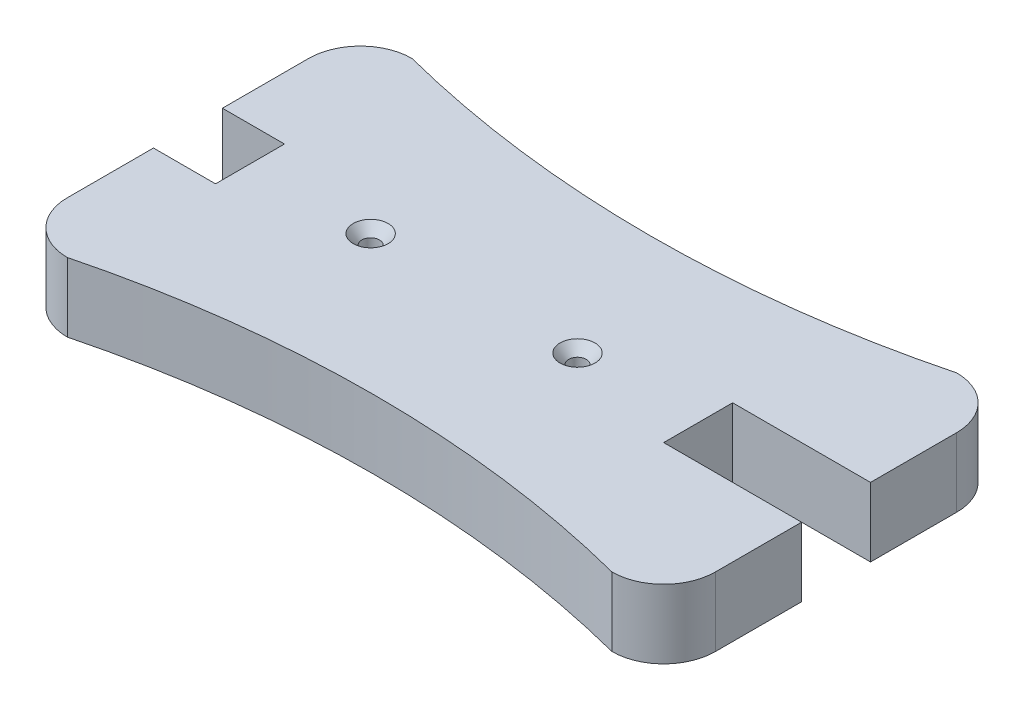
ISO-10303-21;
HEADER;
FILE_DESCRIPTION(('STEP AP214'),'2;1');
FILE_NAME('part.step','',(''),(''),'','','');
FILE_SCHEMA(('AUTOMOTIVE_DESIGN { 1 0 10303 214 1 1 1 1 }'));
ENDSEC;
DATA;
#1=APPLICATION_CONTEXT('core data for automotive mechanical design processes');
#2=APPLICATION_PROTOCOL_DEFINITION('international standard','automotive_design',2000,#1);
#3=PRODUCT_CONTEXT('',#1,'mechanical');
#4=PRODUCT('Part','Part','',(#3));
#5=PRODUCT_RELATED_PRODUCT_CATEGORY('part','',(#4));
#6=PRODUCT_DEFINITION_FORMATION('','',#4);
#7=PRODUCT_DEFINITION_CONTEXT('part definition',#1,'design');
#8=PRODUCT_DEFINITION('design','',#6,#7);
#9=PRODUCT_DEFINITION_SHAPE('','',#8);
#10=(LENGTH_UNIT() NAMED_UNIT(*) SI_UNIT(.MILLI.,.METRE.));
#11=(NAMED_UNIT(*) PLANE_ANGLE_UNIT() SI_UNIT($,.RADIAN.));
#12=(NAMED_UNIT(*) SI_UNIT($,.STERADIAN.) SOLID_ANGLE_UNIT());
#13=UNCERTAINTY_MEASURE_WITH_UNIT(LENGTH_MEASURE(1.E-05),#10,'distance_accuracy_value','');
#14=(GEOMETRIC_REPRESENTATION_CONTEXT(3) GLOBAL_UNCERTAINTY_ASSIGNED_CONTEXT((#13)) GLOBAL_UNIT_ASSIGNED_CONTEXT((#10,
#11,#12)) REPRESENTATION_CONTEXT('',''));
#15=CARTESIAN_POINT('',(0.,0.,0.));
#16=DIRECTION('',(0.,0.,1.));
#17=DIRECTION('',(1.,0.,0.));
#18=AXIS2_PLACEMENT_3D('',#15,#16,#17);
#19=CARTESIAN_POINT('',(82.55,12.7,63.5));
#20=DIRECTION('',(-1.,0.,0.));
#21=DIRECTION('',(0.,0.,1.));
#22=AXIS2_PLACEMENT_3D('',#19,#20,#21);
#23=PLANE('',#22);
#24=DIRECTION('',(0.,-1.,0.));
#25=VECTOR('',#24,1.);
#26=CARTESIAN_POINT('',(82.55,12.7,-12.7));
#27=LINE('',#26,#25);
#28=CARTESIAN_POINT('',(82.55,12.7,-12.7));
#29=VERTEX_POINT('',#28);
#30=CARTESIAN_POINT('',(82.55,-12.7,-12.7));
#31=VERTEX_POINT('',#30);
#32=EDGE_CURVE('E183',#29,#31,#27,.T.);
#33=ORIENTED_EDGE('',*,*,#32,.F.);
#34=DIRECTION('',(0.,0.,-1.));
#35=VECTOR('',#34,1.);
#36=CARTESIAN_POINT('',(82.55,12.7,63.5));
#37=LINE('',#36,#35);
#38=CARTESIAN_POINT('',(82.55,12.7,12.7));
#39=VERTEX_POINT('',#38);
#40=EDGE_CURVE('E217',#39,#29,#37,.T.);
#41=ORIENTED_EDGE('',*,*,#40,.F.);
#42=DIRECTION('',(0.,1.,0.));
#43=VECTOR('',#42,1.);
#44=CARTESIAN_POINT('',(82.55,12.7,12.7));
#45=LINE('',#44,#43);
#46=CARTESIAN_POINT('',(82.55,-12.7,12.7));
#47=VERTEX_POINT('',#46);
#48=EDGE_CURVE('E201',#47,#39,#45,.T.);
#49=ORIENTED_EDGE('',*,*,#48,.F.);
#50=DIRECTION('',(0.,0.,-1.));
#51=VECTOR('',#50,1.);
#52=CARTESIAN_POINT('',(82.55,-12.7,63.5));
#53=LINE('',#52,#51);
#54=EDGE_CURVE('E375',#47,#31,#53,.T.);
#55=ORIENTED_EDGE('',*,*,#54,.T.);
#56=EDGE_LOOP('',(#33,#41,#49,#55));
#57=FACE_BOUND('',#56,.T.);
#58=ADVANCED_FACE('F37',(#57),#23,.F.);
#59=CARTESIAN_POINT('',(-82.55,12.7,63.5));
#60=DIRECTION('',(1.,0.,0.));
#61=DIRECTION('',(0.,0.,-1.));
#62=AXIS2_PLACEMENT_3D('',#59,#60,#61);
#63=PLANE('',#62);
#64=DIRECTION('',(0.,-1.,0.));
#65=VECTOR('',#64,1.);
#66=CARTESIAN_POINT('',(-82.55,12.7,12.7));
#67=LINE('',#66,#65);
#68=CARTESIAN_POINT('',(-82.55,12.7,12.7));
#69=VERTEX_POINT('',#68);
#70=CARTESIAN_POINT('',(-82.55,-12.7,12.7));
#71=VERTEX_POINT('',#70);
#72=EDGE_CURVE('E227',#69,#71,#67,.T.);
#73=ORIENTED_EDGE('',*,*,#72,.F.);
#74=DIRECTION('',(0.,0.,1.));
#75=VECTOR('',#74,1.);
#76=CARTESIAN_POINT('',(-82.55,12.7,63.5));
#77=LINE('',#76,#75);
#78=CARTESIAN_POINT('',(-82.55,12.7,-12.7));
#79=VERTEX_POINT('',#78);
#80=EDGE_CURVE('E234',#79,#69,#77,.T.);
#81=ORIENTED_EDGE('',*,*,#80,.F.);
#82=DIRECTION('',(0.,1.,0.));
#83=VECTOR('',#82,1.);
#84=CARTESIAN_POINT('',(-82.55,12.7,-12.7));
#85=LINE('',#84,#83);
#86=CARTESIAN_POINT('',(-82.55,-12.7,-12.7));
#87=VERTEX_POINT('',#86);
#88=EDGE_CURVE('E365',#87,#79,#85,.T.);
#89=ORIENTED_EDGE('',*,*,#88,.F.);
#90=DIRECTION('',(0.,0.,1.));
#91=VECTOR('',#90,1.);
#92=CARTESIAN_POINT('',(-82.55,-12.7,63.5));
#93=LINE('',#92,#91);
#94=EDGE_CURVE('E329',#87,#71,#93,.T.);
#95=ORIENTED_EDGE('',*,*,#94,.T.);
#96=EDGE_LOOP('',(#73,#81,#89,#95));
#97=FACE_BOUND('',#96,.T.);
#98=ADVANCED_FACE('F276',(#97),#63,.F.);
#99=CARTESIAN_POINT('',(0.,12.7,0.));
#100=DIRECTION('',(0.,-1.,0.));
#101=DIRECTION('',(0.,0.,-1.));
#102=AXIS2_PLACEMENT_3D('',#99,#100,#101);
#103=PLANE('',#102);
#104=CARTESIAN_POINT('',(-38.1,12.7,0.));
#105=DIRECTION('',(0.,1.,0.));
#106=DIRECTION('',(0.,0.,1.));
#107=AXIS2_PLACEMENT_3D('',#104,#105,#106);
#108=CIRCLE('',#107,6.4389);
#109=CARTESIAN_POINT('',(-38.1,12.7,6.4389));
#110=VERTEX_POINT('',#109);
#111=EDGE_CURVE('E267',#110,#110,#108,.T.);
#112=ORIENTED_EDGE('',*,*,#111,.F.);
#113=EDGE_LOOP('',(#112));
#114=FACE_BOUND('',#113,.T.);
#115=CARTESIAN_POINT('',(38.1,12.7,0.));
#116=DIRECTION('',(0.,1.,0.));
#117=DIRECTION('',(0.,0.,1.));
#118=AXIS2_PLACEMENT_3D('',#115,#116,#117);
#119=CIRCLE('',#118,6.4389);
#120=CARTESIAN_POINT('',(38.1,12.7,6.4389));
#121=VERTEX_POINT('',#120);
#122=EDGE_CURVE('E257',#121,#121,#119,.T.);
#123=ORIENTED_EDGE('',*,*,#122,.F.);
#124=EDGE_LOOP('',(#123));
#125=FACE_BOUND('',#124,.T.);
#126=CARTESIAN_POINT('',(13.97,12.7,-453.4535));
#127=DIRECTION('',(0.,1.,0.));
#128=DIRECTION('',(0.,0.,1.));
#129=AXIS2_PLACEMENT_3D('',#126,#127,#128);
#130=CIRCLE('',#129,402.6535);
#131=CARTESIAN_POINT('',(-86.36,12.7,-63.5));
#132=VERTEX_POINT('',#131);
#133=CARTESIAN_POINT('',(114.3,12.7,-63.5));
#134=VERTEX_POINT('',#133);
#135=EDGE_CURVE('E175',#132,#134,#130,.T.);
#136=ORIENTED_EDGE('',*,*,#135,.F.);
#137=CARTESIAN_POINT('',(-86.36,12.7,-44.45));
#138=DIRECTION('',(0.,-1.,0.));
#139=DIRECTION('',(0.,0.,-1.));
#140=AXIS2_PLACEMENT_3D('',#137,#138,#139);
#141=CIRCLE('',#140,19.05);
#142=CARTESIAN_POINT('',(-105.41,12.7,-44.45));
#143=VERTEX_POINT('',#142);
#144=EDGE_CURVE('E247',#132,#143,#141,.F.);
#145=ORIENTED_EDGE('',*,*,#144,.T.);
#146=DIRECTION('',(0.,0.,-1.));
#147=VECTOR('',#146,1.);
#148=CARTESIAN_POINT('',(-105.41,12.7,-63.5));
#149=LINE('',#148,#147);
#150=CARTESIAN_POINT('',(-105.41,12.7,-12.7));
#151=VERTEX_POINT('',#150);
#152=EDGE_CURVE('E347',#151,#143,#149,.T.);
#153=ORIENTED_EDGE('',*,*,#152,.F.);
#154=DIRECTION('',(1.,0.,0.));
#155=VECTOR('',#154,1.);
#156=CARTESIAN_POINT('',(-105.41,12.7,-12.7));
#157=LINE('',#156,#155);
#158=EDGE_CURVE('E353',#151,#79,#157,.T.);
#159=ORIENTED_EDGE('',*,*,#158,.T.);
#160=ORIENTED_EDGE('',*,*,#80,.T.);
#161=DIRECTION('',(1.,0.,0.));
#162=VECTOR('',#161,1.);
#163=CARTESIAN_POINT('',(-105.41,12.7,12.7));
#164=LINE('',#163,#162);
#165=CARTESIAN_POINT('',(-105.41,12.7,12.7));
#166=VERTEX_POINT('',#165);
#167=EDGE_CURVE('E368',#166,#69,#164,.T.);
#168=ORIENTED_EDGE('',*,*,#167,.F.);
#169=DIRECTION('',(0.,0.,-1.));
#170=VECTOR('',#169,1.);
#171=CARTESIAN_POINT('',(-105.41,12.7,63.5));
#172=LINE('',#171,#170);
#173=CARTESIAN_POINT('',(-105.41,12.7,44.45));
#174=VERTEX_POINT('',#173);
#175=EDGE_CURVE('E159',#174,#166,#172,.T.);
#176=ORIENTED_EDGE('',*,*,#175,.F.);
#177=CARTESIAN_POINT('',(-86.36,12.7,44.45));
#178=DIRECTION('',(0.,-1.,0.));
#179=DIRECTION('',(0.,0.,-1.));
#180=AXIS2_PLACEMENT_3D('',#177,#178,#179);
#181=CIRCLE('',#180,19.05);
#182=CARTESIAN_POINT('',(-86.36,12.7,63.5));
#183=VERTEX_POINT('',#182);
#184=EDGE_CURVE('E54',#174,#183,#181,.F.);
#185=ORIENTED_EDGE('',*,*,#184,.T.);
#186=CARTESIAN_POINT('',(13.97,12.7,453.4535));
#187=DIRECTION('',(0.,1.,0.));
#188=DIRECTION('',(0.,0.,-1.));
#189=AXIS2_PLACEMENT_3D('',#186,#187,#188);
#190=CIRCLE('',#189,402.6535);
#191=CARTESIAN_POINT('',(114.3,12.7,63.5));
#192=VERTEX_POINT('',#191);
#193=EDGE_CURVE('E156',#192,#183,#190,.T.);
#194=ORIENTED_EDGE('',*,*,#193,.F.);
#195=CARTESIAN_POINT('',(114.3,12.7,44.45));
#196=DIRECTION('',(0.,-1.,0.));
#197=DIRECTION('',(0.,0.,-1.));
#198=AXIS2_PLACEMENT_3D('',#195,#196,#197);
#199=CIRCLE('',#198,19.05);
#200=CARTESIAN_POINT('',(133.35,12.7,44.45));
#201=VERTEX_POINT('',#200);
#202=EDGE_CURVE('E160',#192,#201,#199,.F.);
#203=ORIENTED_EDGE('',*,*,#202,.T.);
#204=DIRECTION('',(0.,0.,1.));
#205=VECTOR('',#204,1.);
#206=CARTESIAN_POINT('',(133.35,12.7,63.5));
#207=LINE('',#206,#205);
#208=CARTESIAN_POINT('',(133.35,12.7,12.7));
#209=VERTEX_POINT('',#208);
#210=EDGE_CURVE('E206',#209,#201,#207,.T.);
#211=ORIENTED_EDGE('',*,*,#210,.F.);
#212=DIRECTION('',(-1.,0.,0.));
#213=VECTOR('',#212,1.);
#214=CARTESIAN_POINT('',(133.35,12.7,12.7));
#215=LINE('',#214,#213);
#216=EDGE_CURVE('E209',#209,#39,#215,.T.);
#217=ORIENTED_EDGE('',*,*,#216,.T.);
#218=ORIENTED_EDGE('',*,*,#40,.T.);
#219=DIRECTION('',(-1.,0.,0.));
#220=VECTOR('',#219,1.);
#221=CARTESIAN_POINT('',(133.35,12.7,-12.7));
#222=LINE('',#221,#220);
#223=CARTESIAN_POINT('',(133.35,12.7,-12.7));
#224=VERTEX_POINT('',#223);
#225=EDGE_CURVE('E193',#224,#29,#222,.T.);
#226=ORIENTED_EDGE('',*,*,#225,.F.);
#227=DIRECTION('',(0.,0.,1.));
#228=VECTOR('',#227,1.);
#229=CARTESIAN_POINT('',(133.35,12.7,-12.7));
#230=LINE('',#229,#228);
#231=CARTESIAN_POINT('',(133.35,12.7,-44.45));
#232=VERTEX_POINT('',#231);
#233=EDGE_CURVE('E191',#232,#224,#230,.T.);
#234=ORIENTED_EDGE('',*,*,#233,.F.);
#235=CARTESIAN_POINT('',(114.3,12.7,-44.45));
#236=DIRECTION('',(0.,-1.,0.));
#237=DIRECTION('',(0.,0.,-1.));
#238=AXIS2_PLACEMENT_3D('',#235,#236,#237);
#239=CIRCLE('',#238,19.05);
#240=EDGE_CURVE('E61',#232,#134,#239,.F.);
#241=ORIENTED_EDGE('',*,*,#240,.T.);
#242=EDGE_LOOP('',(#136,#145,#153,#159,#160,#168,#176,#185,#194,#203,#211,#217,#218,#226,#234,#241));
#243=FACE_BOUND('',#242,.T.);
#244=ADVANCED_FACE('F155',(#114,#125,#243),#103,.F.);
#245=CARTESIAN_POINT('',(0.,-12.7,0.));
#246=DIRECTION('',(0.,-1.,0.));
#247=DIRECTION('',(0.,0.,-1.));
#248=AXIS2_PLACEMENT_3D('',#245,#246,#247);
#249=PLANE('',#248);
#250=CARTESIAN_POINT('',(-38.1,-12.7,0.));
#251=DIRECTION('',(0.,-1.,0.));
#252=DIRECTION('',(0.,0.,-1.));
#253=AXIS2_PLACEMENT_3D('',#250,#251,#252);
#254=CIRCLE('',#253,3.26389999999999);
#255=CARTESIAN_POINT('',(-38.1,-12.7,-3.26389999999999));
#256=VERTEX_POINT('',#255);
#257=EDGE_CURVE('E41',#256,#256,#254,.T.);
#258=ORIENTED_EDGE('',*,*,#257,.F.);
#259=EDGE_LOOP('',(#258));
#260=FACE_BOUND('',#259,.T.);
#261=CARTESIAN_POINT('',(38.1,-12.7,0.));
#262=DIRECTION('',(0.,-1.,0.));
#263=DIRECTION('',(0.,0.,-1.));
#264=AXIS2_PLACEMENT_3D('',#261,#262,#263);
#265=CIRCLE('',#264,3.26389999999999);
#266=CARTESIAN_POINT('',(38.1,-12.7,-3.26389999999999));
#267=VERTEX_POINT('',#266);
#268=EDGE_CURVE('E170',#267,#267,#265,.T.);
#269=ORIENTED_EDGE('',*,*,#268,.F.);
#270=EDGE_LOOP('',(#269));
#271=FACE_BOUND('',#270,.T.);
#272=DIRECTION('',(0.,0.,1.));
#273=VECTOR('',#272,1.);
#274=CARTESIAN_POINT('',(-105.41,-12.7,-63.5));
#275=LINE('',#274,#273);
#276=CARTESIAN_POINT('',(-105.41,-12.7,-44.45));
#277=VERTEX_POINT('',#276);
#278=CARTESIAN_POINT('',(-105.41,-12.7,-12.7));
#279=VERTEX_POINT('',#278);
#280=EDGE_CURVE('E357',#277,#279,#275,.T.);
#281=ORIENTED_EDGE('',*,*,#280,.F.);
#282=CARTESIAN_POINT('',(-86.36,-12.7,-44.45));
#283=DIRECTION('',(0.,-1.,0.));
#284=DIRECTION('',(0.,0.,-1.));
#285=AXIS2_PLACEMENT_3D('',#282,#283,#284);
#286=CIRCLE('',#285,19.05);
#287=CARTESIAN_POINT('',(-86.36,-12.7,-63.5));
#288=VERTEX_POINT('',#287);
#289=EDGE_CURVE('E161',#277,#288,#286,.T.);
#290=ORIENTED_EDGE('',*,*,#289,.T.);
#291=CARTESIAN_POINT('',(13.97,-12.7,-453.4535));
#292=DIRECTION('',(0.,-1.,0.));
#293=DIRECTION('',(0.,0.,-1.));
#294=AXIS2_PLACEMENT_3D('',#291,#292,#293);
#295=CIRCLE('',#294,402.6535);
#296=CARTESIAN_POINT('',(114.3,-12.7,-63.5));
#297=VERTEX_POINT('',#296);
#298=EDGE_CURVE('E230',#297,#288,#295,.T.);
#299=ORIENTED_EDGE('',*,*,#298,.F.);
#300=CARTESIAN_POINT('',(114.3,-12.7,-44.45));
#301=DIRECTION('',(0.,-1.,0.));
#302=DIRECTION('',(0.,0.,-1.));
#303=AXIS2_PLACEMENT_3D('',#300,#301,#302);
#304=CIRCLE('',#303,19.05);
#305=CARTESIAN_POINT('',(133.35,-12.7,-44.45));
#306=VERTEX_POINT('',#305);
#307=EDGE_CURVE('E242',#297,#306,#304,.T.);
#308=ORIENTED_EDGE('',*,*,#307,.T.);
#309=DIRECTION('',(0.,0.,-1.));
#310=VECTOR('',#309,1.);
#311=CARTESIAN_POINT('',(133.35,-12.7,-12.7));
#312=LINE('',#311,#310);
#313=CARTESIAN_POINT('',(133.35,-12.7,-12.7));
#314=VERTEX_POINT('',#313);
#315=EDGE_CURVE('E188',#314,#306,#312,.T.);
#316=ORIENTED_EDGE('',*,*,#315,.F.);
#317=DIRECTION('',(-1.,0.,0.));
#318=VECTOR('',#317,1.);
#319=CARTESIAN_POINT('',(133.35,-12.7,-12.7));
#320=LINE('',#319,#318);
#321=EDGE_CURVE('E198',#314,#31,#320,.T.);
#322=ORIENTED_EDGE('',*,*,#321,.T.);
#323=ORIENTED_EDGE('',*,*,#54,.F.);
#324=DIRECTION('',(-1.,0.,0.));
#325=VECTOR('',#324,1.);
#326=CARTESIAN_POINT('',(133.35,-12.7,12.7));
#327=LINE('',#326,#325);
#328=CARTESIAN_POINT('',(133.35,-12.7,12.7));
#329=VERTEX_POINT('',#328);
#330=EDGE_CURVE('E222',#329,#47,#327,.T.);
#331=ORIENTED_EDGE('',*,*,#330,.F.);
#332=DIRECTION('',(0.,0.,-1.));
#333=VECTOR('',#332,1.);
#334=CARTESIAN_POINT('',(133.35,-12.7,63.5));
#335=LINE('',#334,#333);
#336=CARTESIAN_POINT('',(133.35,-12.7,44.45));
#337=VERTEX_POINT('',#336);
#338=EDGE_CURVE('E202',#337,#329,#335,.T.);
#339=ORIENTED_EDGE('',*,*,#338,.F.);
#340=CARTESIAN_POINT('',(114.3,-12.7,44.45));
#341=DIRECTION('',(0.,-1.,0.));
#342=DIRECTION('',(0.,0.,-1.));
#343=AXIS2_PLACEMENT_3D('',#340,#341,#342);
#344=CIRCLE('',#343,19.05);
#345=CARTESIAN_POINT('',(114.3,-12.7,63.5));
#346=VERTEX_POINT('',#345);
#347=EDGE_CURVE('E240',#337,#346,#344,.T.);
#348=ORIENTED_EDGE('',*,*,#347,.T.);
#349=CARTESIAN_POINT('',(13.97,-12.7,453.4535));
#350=DIRECTION('',(0.,-1.,0.));
#351=DIRECTION('',(0.,0.,-1.));
#352=AXIS2_PLACEMENT_3D('',#349,#350,#351);
#353=CIRCLE('',#352,402.6535);
#354=CARTESIAN_POINT('',(-86.36,-12.7,63.5));
#355=VERTEX_POINT('',#354);
#356=EDGE_CURVE('E233',#355,#346,#353,.T.);
#357=ORIENTED_EDGE('',*,*,#356,.F.);
#358=CARTESIAN_POINT('',(-86.36,-12.7,44.45));
#359=DIRECTION('',(0.,-1.,0.));
#360=DIRECTION('',(0.,0.,-1.));
#361=AXIS2_PLACEMENT_3D('',#358,#359,#360);
#362=CIRCLE('',#361,19.05);
#363=CARTESIAN_POINT('',(-105.41,-12.7,44.45));
#364=VERTEX_POINT('',#363);
#365=EDGE_CURVE('E173',#355,#364,#362,.T.);
#366=ORIENTED_EDGE('',*,*,#365,.T.);
#367=DIRECTION('',(0.,0.,1.));
#368=VECTOR('',#367,1.);
#369=CARTESIAN_POINT('',(-105.41,-12.7,63.5));
#370=LINE('',#369,#368);
#371=CARTESIAN_POINT('',(-105.41,-12.7,12.7));
#372=VERTEX_POINT('',#371);
#373=EDGE_CURVE('E396',#372,#364,#370,.T.);
#374=ORIENTED_EDGE('',*,*,#373,.F.);
#375=DIRECTION('',(1.,0.,0.));
#376=VECTOR('',#375,1.);
#377=CARTESIAN_POINT('',(-105.41,-12.7,12.7));
#378=LINE('',#377,#376);
#379=EDGE_CURVE('E392',#372,#71,#378,.T.);
#380=ORIENTED_EDGE('',*,*,#379,.T.);
#381=ORIENTED_EDGE('',*,*,#94,.F.);
#382=DIRECTION('',(1.,0.,0.));
#383=VECTOR('',#382,1.);
#384=CARTESIAN_POINT('',(-105.41,-12.7,-12.7));
#385=LINE('',#384,#383);
#386=EDGE_CURVE('E355',#279,#87,#385,.T.);
#387=ORIENTED_EDGE('',*,*,#386,.F.);
#388=EDGE_LOOP('',(#281,#290,#299,#308,#316,#322,#323,#331,#339,#348,#357,#366,#374,#380,#381,#387));
#389=FACE_BOUND('',#388,.T.);
#390=ADVANCED_FACE('F275',(#260,#271,#389),#249,.T.);
#391=CARTESIAN_POINT('',(-105.41,12.7,-12.7));
#392=DIRECTION('',(0.,0.,-1.));
#393=DIRECTION('',(-1.,0.,0.));
#394=AXIS2_PLACEMENT_3D('',#391,#392,#393);
#395=PLANE('',#394);
#396=ORIENTED_EDGE('',*,*,#88,.T.);
#397=ORIENTED_EDGE('',*,*,#158,.F.);
#398=DIRECTION('',(0.,1.,0.));
#399=VECTOR('',#398,1.);
#400=CARTESIAN_POINT('',(-105.41,12.7,-12.7));
#401=LINE('',#400,#399);
#402=EDGE_CURVE('E351',#279,#151,#401,.T.);
#403=ORIENTED_EDGE('',*,*,#402,.F.);
#404=ORIENTED_EDGE('',*,*,#386,.T.);
#405=EDGE_LOOP('',(#396,#397,#403,#404));
#406=FACE_BOUND('',#405,.T.);
#407=ADVANCED_FACE('F402',(#406),#395,.F.);
#408=CARTESIAN_POINT('',(-105.41,0.,0.));
#409=DIRECTION('',(-1.,0.,0.));
#410=DIRECTION('',(0.,0.,1.));
#411=AXIS2_PLACEMENT_3D('',#408,#409,#410);
#412=PLANE('',#411);
#413=ORIENTED_EDGE('',*,*,#152,.T.);
#414=DIRECTION('',(0.,-1.,0.));
#415=VECTOR('',#414,1.);
#416=CARTESIAN_POINT('',(-105.41,-12.7,-44.45));
#417=LINE('',#416,#415);
#418=EDGE_CURVE('E236',#143,#277,#417,.T.);
#419=ORIENTED_EDGE('',*,*,#418,.T.);
#420=ORIENTED_EDGE('',*,*,#280,.T.);
#421=ORIENTED_EDGE('',*,*,#402,.T.);
#422=EDGE_LOOP('',(#413,#419,#420,#421));
#423=FACE_BOUND('',#422,.T.);
#424=ADVANCED_FACE('F349',(#423),#412,.T.);
#425=CARTESIAN_POINT('',(-105.41,12.7,12.7));
#426=DIRECTION('',(0.,0.,1.));
#427=DIRECTION('',(1.,0.,0.));
#428=AXIS2_PLACEMENT_3D('',#425,#426,#427);
#429=PLANE('',#428);
#430=ORIENTED_EDGE('',*,*,#72,.T.);
#431=ORIENTED_EDGE('',*,*,#379,.F.);
#432=DIRECTION('',(0.,-1.,0.));
#433=VECTOR('',#432,1.);
#434=CARTESIAN_POINT('',(-105.41,12.7,12.7));
#435=LINE('',#434,#433);
#436=EDGE_CURVE('E399',#166,#372,#435,.T.);
#437=ORIENTED_EDGE('',*,*,#436,.F.);
#438=ORIENTED_EDGE('',*,*,#167,.T.);
#439=EDGE_LOOP('',(#430,#431,#437,#438));
#440=FACE_BOUND('',#439,.T.);
#441=ADVANCED_FACE('F390',(#440),#429,.F.);
#442=CARTESIAN_POINT('',(-105.41,0.,0.));
#443=DIRECTION('',(1.,0.,0.));
#444=DIRECTION('',(0.,0.,-1.));
#445=AXIS2_PLACEMENT_3D('',#442,#443,#444);
#446=PLANE('',#445);
#447=ORIENTED_EDGE('',*,*,#373,.T.);
#448=DIRECTION('',(0.,1.,0.));
#449=VECTOR('',#448,1.);
#450=CARTESIAN_POINT('',(-105.41,0.,44.45));
#451=LINE('',#450,#449);
#452=EDGE_CURVE('E11',#364,#174,#451,.T.);
#453=ORIENTED_EDGE('',*,*,#452,.T.);
#454=ORIENTED_EDGE('',*,*,#175,.T.);
#455=ORIENTED_EDGE('',*,*,#436,.T.);
#456=EDGE_LOOP('',(#447,#453,#454,#455));
#457=FACE_BOUND('',#456,.T.);
#458=ADVANCED_FACE('F404',(#457),#446,.F.);
#459=CARTESIAN_POINT('',(133.35,12.7,12.7));
#460=DIRECTION('',(0.,0.,1.));
#461=DIRECTION('',(1.,0.,0.));
#462=AXIS2_PLACEMENT_3D('',#459,#460,#461);
#463=PLANE('',#462);
#464=ORIENTED_EDGE('',*,*,#48,.T.);
#465=ORIENTED_EDGE('',*,*,#216,.F.);
#466=DIRECTION('',(0.,1.,0.));
#467=VECTOR('',#466,1.);
#468=CARTESIAN_POINT('',(133.35,12.7,12.7));
#469=LINE('',#468,#467);
#470=EDGE_CURVE('E204',#329,#209,#469,.T.);
#471=ORIENTED_EDGE('',*,*,#470,.F.);
#472=ORIENTED_EDGE('',*,*,#330,.T.);
#473=EDGE_LOOP('',(#464,#465,#471,#472));
#474=FACE_BOUND('',#473,.T.);
#475=ADVANCED_FACE('F324',(#474),#463,.F.);
#476=CARTESIAN_POINT('',(133.35,0.,0.));
#477=DIRECTION('',(1.,0.,0.));
#478=DIRECTION('',(0.,0.,-1.));
#479=AXIS2_PLACEMENT_3D('',#476,#477,#478);
#480=PLANE('',#479);
#481=ORIENTED_EDGE('',*,*,#210,.T.);
#482=DIRECTION('',(0.,-1.,0.));
#483=VECTOR('',#482,1.);
#484=CARTESIAN_POINT('',(133.35,-12.7,44.45));
#485=LINE('',#484,#483);
#486=EDGE_CURVE('E46',#201,#337,#485,.T.);
#487=ORIENTED_EDGE('',*,*,#486,.T.);
#488=ORIENTED_EDGE('',*,*,#338,.T.);
#489=ORIENTED_EDGE('',*,*,#470,.T.);
#490=EDGE_LOOP('',(#481,#487,#488,#489));
#491=FACE_BOUND('',#490,.T.);
#492=ADVANCED_FACE('F318',(#491),#480,.T.);
#493=CARTESIAN_POINT('',(133.35,12.7,-12.7));
#494=DIRECTION('',(0.,0.,-1.));
#495=DIRECTION('',(-1.,0.,0.));
#496=AXIS2_PLACEMENT_3D('',#493,#494,#495);
#497=PLANE('',#496);
#498=ORIENTED_EDGE('',*,*,#32,.T.);
#499=ORIENTED_EDGE('',*,*,#321,.F.);
#500=DIRECTION('',(0.,-1.,0.));
#501=VECTOR('',#500,1.);
#502=CARTESIAN_POINT('',(133.35,12.7,-12.7));
#503=LINE('',#502,#501);
#504=EDGE_CURVE('E185',#224,#314,#503,.T.);
#505=ORIENTED_EDGE('',*,*,#504,.F.);
#506=ORIENTED_EDGE('',*,*,#225,.T.);
#507=EDGE_LOOP('',(#498,#499,#505,#506));
#508=FACE_BOUND('',#507,.T.);
#509=ADVANCED_FACE('F331',(#508),#497,.F.);
#510=CARTESIAN_POINT('',(133.35,0.,0.));
#511=DIRECTION('',(1.,0.,0.));
#512=DIRECTION('',(0.,0.,-1.));
#513=AXIS2_PLACEMENT_3D('',#510,#511,#512);
#514=PLANE('',#513);
#515=ORIENTED_EDGE('',*,*,#315,.T.);
#516=DIRECTION('',(0.,1.,0.));
#517=VECTOR('',#516,1.);
#518=CARTESIAN_POINT('',(133.35,12.7,-44.45));
#519=LINE('',#518,#517);
#520=EDGE_CURVE('E249',#306,#232,#519,.T.);
#521=ORIENTED_EDGE('',*,*,#520,.T.);
#522=ORIENTED_EDGE('',*,*,#233,.T.);
#523=ORIENTED_EDGE('',*,*,#504,.T.);
#524=EDGE_LOOP('',(#515,#521,#522,#523));
#525=FACE_BOUND('',#524,.T.);
#526=ADVANCED_FACE('F334',(#525),#514,.T.);
#527=CARTESIAN_POINT('',(13.97,-12.70005,-453.4535));
#528=DIRECTION('',(0.,1.,0.));
#529=DIRECTION('',(0.,0.,1.));
#530=AXIS2_PLACEMENT_3D('',#527,#528,#529);
#531=CYLINDRICAL_SURFACE('',#530,402.6535);
#532=ORIENTED_EDGE('',*,*,#298,.T.);
#533=DIRECTION('',(0.,1.,0.));
#534=VECTOR('',#533,1.);
#535=CARTESIAN_POINT('',(-86.36,-12.70005,-63.5));
#536=LINE('',#535,#534);
#537=EDGE_CURVE('E181',#288,#132,#536,.T.);
#538=ORIENTED_EDGE('',*,*,#537,.T.);
#539=ORIENTED_EDGE('',*,*,#135,.T.);
#540=DIRECTION('',(0.,1.,0.));
#541=VECTOR('',#540,1.);
#542=CARTESIAN_POINT('',(114.3,-12.70005,-63.5));
#543=LINE('',#542,#541);
#544=EDGE_CURVE('E180',#297,#134,#543,.T.);
#545=ORIENTED_EDGE('',*,*,#544,.F.);
#546=EDGE_LOOP('',(#532,#538,#539,#545));
#547=FACE_BOUND('',#546,.T.);
#548=ADVANCED_FACE('F337',(#547),#531,.F.);
#549=CARTESIAN_POINT('',(13.97,-12.70005,453.4535));
#550=DIRECTION('',(0.,1.,0.));
#551=DIRECTION('',(0.,0.,1.));
#552=AXIS2_PLACEMENT_3D('',#549,#550,#551);
#553=CYLINDRICAL_SURFACE('',#552,402.6535);
#554=ORIENTED_EDGE('',*,*,#356,.T.);
#555=DIRECTION('',(0.,1.,0.));
#556=VECTOR('',#555,1.);
#557=CARTESIAN_POINT('',(114.3,-12.70005,63.5));
#558=LINE('',#557,#556);
#559=EDGE_CURVE('E169',#346,#192,#558,.T.);
#560=ORIENTED_EDGE('',*,*,#559,.T.);
#561=ORIENTED_EDGE('',*,*,#193,.T.);
#562=DIRECTION('',(0.,1.,0.));
#563=VECTOR('',#562,1.);
#564=CARTESIAN_POINT('',(-86.36,-12.70005,63.5));
#565=LINE('',#564,#563);
#566=EDGE_CURVE('E166',#355,#183,#565,.T.);
#567=ORIENTED_EDGE('',*,*,#566,.F.);
#568=EDGE_LOOP('',(#554,#560,#561,#567));
#569=FACE_BOUND('',#568,.T.);
#570=ADVANCED_FACE('F165',(#569),#553,.F.);
#571=CARTESIAN_POINT('',(-86.36,0.,-44.45));
#572=DIRECTION('',(0.,1.,0.));
#573=DIRECTION('',(0.,0.,1.));
#574=AXIS2_PLACEMENT_3D('',#571,#572,#573);
#575=CYLINDRICAL_SURFACE('',#574,19.05);
#576=ORIENTED_EDGE('',*,*,#144,.F.);
#577=ORIENTED_EDGE('',*,*,#537,.F.);
#578=ORIENTED_EDGE('',*,*,#289,.F.);
#579=ORIENTED_EDGE('',*,*,#418,.F.);
#580=EDGE_LOOP('',(#576,#577,#578,#579));
#581=FACE_BOUND('',#580,.T.);
#582=ADVANCED_FACE('F303',(#581),#575,.T.);
#583=CARTESIAN_POINT('',(114.3,0.,-44.45));
#584=DIRECTION('',(0.,-1.,0.));
#585=DIRECTION('',(0.,0.,-1.));
#586=AXIS2_PLACEMENT_3D('',#583,#584,#585);
#587=CYLINDRICAL_SURFACE('',#586,19.05);
#588=ORIENTED_EDGE('',*,*,#307,.F.);
#589=ORIENTED_EDGE('',*,*,#544,.T.);
#590=ORIENTED_EDGE('',*,*,#240,.F.);
#591=ORIENTED_EDGE('',*,*,#520,.F.);
#592=EDGE_LOOP('',(#588,#589,#590,#591));
#593=FACE_BOUND('',#592,.T.);
#594=ADVANCED_FACE('F306',(#593),#587,.T.);
#595=CARTESIAN_POINT('',(114.3,0.,44.45));
#596=DIRECTION('',(0.,1.,0.));
#597=DIRECTION('',(0.,0.,1.));
#598=AXIS2_PLACEMENT_3D('',#595,#596,#597);
#599=CYLINDRICAL_SURFACE('',#598,19.05);
#600=ORIENTED_EDGE('',*,*,#202,.F.);
#601=ORIENTED_EDGE('',*,*,#559,.F.);
#602=ORIENTED_EDGE('',*,*,#347,.F.);
#603=ORIENTED_EDGE('',*,*,#486,.F.);
#604=EDGE_LOOP('',(#600,#601,#602,#603));
#605=FACE_BOUND('',#604,.T.);
#606=ADVANCED_FACE('F309',(#605),#599,.T.);
#607=CARTESIAN_POINT('',(-86.36,0.,44.45));
#608=DIRECTION('',(0.,1.,0.));
#609=DIRECTION('',(0.,0.,1.));
#610=AXIS2_PLACEMENT_3D('',#607,#608,#609);
#611=CYLINDRICAL_SURFACE('',#610,19.05);
#612=ORIENTED_EDGE('',*,*,#365,.F.);
#613=ORIENTED_EDGE('',*,*,#566,.T.);
#614=ORIENTED_EDGE('',*,*,#184,.F.);
#615=ORIENTED_EDGE('',*,*,#452,.F.);
#616=EDGE_LOOP('',(#612,#613,#614,#615));
#617=FACE_BOUND('',#616,.T.);
#618=ADVANCED_FACE('F39',(#617),#611,.T.);
#619=CARTESIAN_POINT('',(38.1,12.7,0.));
#620=DIRECTION('',(0.,1.,0.));
#621=DIRECTION('',(0.,0.,1.));
#622=AXIS2_PLACEMENT_3D('',#619,#620,#621);
#623=CYLINDRICAL_SURFACE('',#622,3.26389999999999);
#624=ORIENTED_EDGE('',*,*,#268,.T.);
#625=EDGE_LOOP('',(#624));
#626=FACE_BOUND('',#625,.T.);
#627=CARTESIAN_POINT('',(38.1,9.04758030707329,0.));
#628=DIRECTION('',(0.,1.,0.));
#629=DIRECTION('',(0.,0.,1.));
#630=AXIS2_PLACEMENT_3D('',#627,#628,#629);
#631=CIRCLE('',#630,3.26389999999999);
#632=CARTESIAN_POINT('',(38.1,9.04758030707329,3.26389999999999));
#633=VERTEX_POINT('',#632);
#634=EDGE_CURVE('E253',#633,#633,#631,.T.);
#635=ORIENTED_EDGE('',*,*,#634,.T.);
#636=EDGE_LOOP('',(#635));
#637=FACE_BOUND('',#636,.T.);
#638=ADVANCED_FACE('F283',(#626,#637),#623,.F.);
#639=CARTESIAN_POINT('',(38.1,12.7,0.));
#640=DIRECTION('',(0.,1.,0.));
#641=DIRECTION('',(0.,0.,1.));
#642=AXIS2_PLACEMENT_3D('',#639,#640,#641);
#643=CONICAL_SURFACE('',#642,6.4389,0.715584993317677);
#644=ORIENTED_EDGE('',*,*,#634,.F.);
#645=EDGE_LOOP('',(#644));
#646=FACE_BOUND('',#645,.T.);
#647=ORIENTED_EDGE('',*,*,#122,.T.);
#648=EDGE_LOOP('',(#647));
#649=FACE_BOUND('',#648,.T.);
#650=ADVANCED_FACE('F280',(#646,#649),#643,.F.);
#651=CARTESIAN_POINT('',(-38.1,12.7,0.));
#652=DIRECTION('',(0.,1.,0.));
#653=DIRECTION('',(0.,0.,1.));
#654=AXIS2_PLACEMENT_3D('',#651,#652,#653);
#655=CYLINDRICAL_SURFACE('',#654,3.26389999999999);
#656=ORIENTED_EDGE('',*,*,#257,.T.);
#657=EDGE_LOOP('',(#656));
#658=FACE_BOUND('',#657,.T.);
#659=CARTESIAN_POINT('',(-38.1,9.04758030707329,0.));
#660=DIRECTION('',(0.,1.,0.));
#661=DIRECTION('',(0.,0.,1.));
#662=AXIS2_PLACEMENT_3D('',#659,#660,#661);
#663=CIRCLE('',#662,3.26389999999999);
#664=CARTESIAN_POINT('',(-38.1,9.04758030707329,3.26389999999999));
#665=VERTEX_POINT('',#664);
#666=EDGE_CURVE('E264',#665,#665,#663,.T.);
#667=ORIENTED_EDGE('',*,*,#666,.T.);
#668=EDGE_LOOP('',(#667));
#669=FACE_BOUND('',#668,.T.);
#670=ADVANCED_FACE('F282',(#658,#669),#655,.F.);
#671=CARTESIAN_POINT('',(-38.1,12.7,0.));
#672=DIRECTION('',(0.,1.,0.));
#673=DIRECTION('',(0.,0.,1.));
#674=AXIS2_PLACEMENT_3D('',#671,#672,#673);
#675=CONICAL_SURFACE('',#674,6.4389,0.715584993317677);
#676=ORIENTED_EDGE('',*,*,#666,.F.);
#677=EDGE_LOOP('',(#676));
#678=FACE_BOUND('',#677,.T.);
#679=ORIENTED_EDGE('',*,*,#111,.T.);
#680=EDGE_LOOP('',(#679));
#681=FACE_BOUND('',#680,.T.);
#682=ADVANCED_FACE('F271',(#678,#681),#675,.F.);
#683=CLOSED_SHELL('',(#58,#98,#244,#390,#407,#424,#441,#458,#475,#492,#509,#526,#548,#570,#582,
#594,#606,#618,#638,#650,#670,#682));
#684=MANIFOLD_SOLID_BREP('B2',#683);
#685=ADVANCED_BREP_SHAPE_REPRESENTATION('',(#18,#684),#14);
#686=SHAPE_DEFINITION_REPRESENTATION(#9,#685);
ENDSEC;
END-ISO-10303-21;
